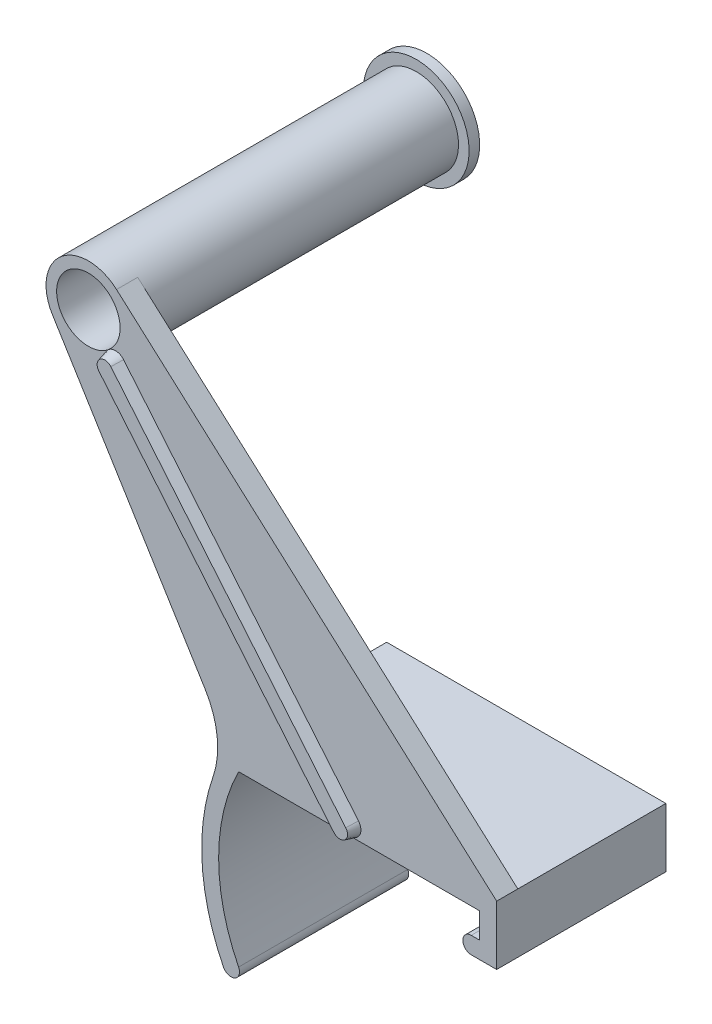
ISO-10303-21;
HEADER;
FILE_DESCRIPTION(('STEP AP214'),'2;1');
FILE_NAME('part.step','',(''),(''),'','','');
FILE_SCHEMA(('AUTOMOTIVE_DESIGN { 1 0 10303 214 1 1 1 1 }'));
ENDSEC;
DATA;
#1=APPLICATION_CONTEXT('core data for automotive mechanical design processes');
#2=APPLICATION_PROTOCOL_DEFINITION('international standard','automotive_design',2000,#1);
#3=PRODUCT_CONTEXT('',#1,'mechanical');
#4=PRODUCT('Part','Part','',(#3));
#5=PRODUCT_RELATED_PRODUCT_CATEGORY('part','',(#4));
#6=PRODUCT_DEFINITION_FORMATION('','',#4);
#7=PRODUCT_DEFINITION_CONTEXT('part definition',#1,'design');
#8=PRODUCT_DEFINITION('design','',#6,#7);
#9=PRODUCT_DEFINITION_SHAPE('','',#8);
#10=(LENGTH_UNIT() NAMED_UNIT(*) SI_UNIT(.MILLI.,.METRE.));
#11=(NAMED_UNIT(*) PLANE_ANGLE_UNIT() SI_UNIT($,.RADIAN.));
#12=(NAMED_UNIT(*) SI_UNIT($,.STERADIAN.) SOLID_ANGLE_UNIT());
#13=UNCERTAINTY_MEASURE_WITH_UNIT(LENGTH_MEASURE(1.E-05),#10,'distance_accuracy_value','');
#14=(GEOMETRIC_REPRESENTATION_CONTEXT(3) GLOBAL_UNCERTAINTY_ASSIGNED_CONTEXT((#13)) GLOBAL_UNIT_ASSIGNED_CONTEXT((#10,
#11,#12)) REPRESENTATION_CONTEXT('',''));
#15=CARTESIAN_POINT('',(0.,0.,0.));
#16=DIRECTION('',(0.,0.,1.));
#17=DIRECTION('',(1.,0.,0.));
#18=AXIS2_PLACEMENT_3D('',#15,#16,#17);
#19=CARTESIAN_POINT('',(0.,0.,0.));
#20=DIRECTION('',(0.,0.,1.));
#21=DIRECTION('',(1.,0.,0.));
#22=AXIS2_PLACEMENT_3D('',#19,#20,#21);
#23=PLANE('',#22);
#24=CARTESIAN_POINT('',(-117.495767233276,105.186312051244,0.));
#25=DIRECTION('',(0.,0.,1.));
#26=DIRECTION('',(1.,0.,0.));
#27=AXIS2_PLACEMENT_3D('',#24,#25,#26);
#28=CIRCLE('',#27,9.52499999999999);
#29=CARTESIAN_POINT('',(-111.39820969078,97.8688386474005,0.));
#30=VERTEX_POINT('',#29);
#31=EDGE_CURVE('E268',#30,#30,#28,.T.);
#32=ORIENTED_EDGE('',*,*,#31,.F.);
#33=CARTESIAN_POINT('',(-109.365690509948,95.4296808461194,0.));
#34=DIRECTION('',(0.,0.,1.));
#35=DIRECTION('',(1.,0.,0.));
#36=AXIS2_PLACEMENT_3D('',#33,#34,#35);
#37=CIRCLE('',#36,3.175);
#38=CARTESIAN_POINT('',(-106.926532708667,97.4622000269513,0.));
#39=VERTEX_POINT('',#38);
#40=EDGE_CURVE('E11',#30,#39,#37,.F.);
#41=ORIENTED_EDGE('',*,*,#40,.T.);
#42=DIRECTION('',(0.640163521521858,-0.768238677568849,0.));
#43=VECTOR('',#42,1.);
#44=CARTESIAN_POINT('',(-15.1752897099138,-12.6453759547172,0.));
#45=LINE('',#44,#43);
#46=CARTESIAN_POINT('',(-36.4015293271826,12.8275191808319,0.));
#47=VERTEX_POINT('',#46);
#48=EDGE_CURVE('E56',#39,#47,#45,.T.);
#49=ORIENTED_EDGE('',*,*,#48,.T.);
#50=CARTESIAN_POINT('',(-38.8406871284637,10.795,0.));
#51=DIRECTION('',(0.,0.,1.));
#52=DIRECTION('',(1.,0.,0.));
#53=AXIS2_PLACEMENT_3D('',#50,#51,#52);
#54=CIRCLE('',#53,3.175);
#55=CARTESIAN_POINT('',(-38.8406871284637,7.62,0.));
#56=VERTEX_POINT('',#55);
#57=EDGE_CURVE('E44',#56,#47,#54,.T.);
#58=ORIENTED_EDGE('',*,*,#57,.F.);
#59=DIRECTION('',(-1.,0.,0.));
#60=VECTOR('',#59,1.);
#61=CARTESIAN_POINT('',(0.,7.62,0.));
#62=LINE('',#61,#60);
#63=CARTESIAN_POINT('',(0.,7.62,0.));
#64=VERTEX_POINT('',#63);
#65=EDGE_CURVE('E295',#64,#56,#62,.T.);
#66=ORIENTED_EDGE('',*,*,#65,.F.);
#67=DIRECTION('',(0.,1.,0.));
#68=VECTOR('',#67,1.);
#69=CARTESIAN_POINT('',(0.,0.,0.));
#70=LINE('',#69,#68);
#71=CARTESIAN_POINT('',(0.,0.,0.));
#72=VERTEX_POINT('',#71);
#73=EDGE_CURVE('E297',#72,#64,#70,.T.);
#74=ORIENTED_EDGE('',*,*,#73,.F.);
#75=DIRECTION('',(1.,0.,0.));
#76=VECTOR('',#75,1.);
#77=CARTESIAN_POINT('',(0.,0.,0.));
#78=LINE('',#77,#76);
#79=CARTESIAN_POINT('',(-2.54,0.,0.));
#80=VERTEX_POINT('',#79);
#81=EDGE_CURVE('E299',#80,#72,#78,.T.);
#82=ORIENTED_EDGE('',*,*,#81,.F.);
#83=CARTESIAN_POINT('',(-2.54,-2.54,0.));
#84=DIRECTION('',(0.,0.,1.));
#85=DIRECTION('',(1.,0.,0.));
#86=AXIS2_PLACEMENT_3D('',#83,#84,#85);
#87=CIRCLE('',#86,2.54);
#88=CARTESIAN_POINT('',(-2.54,-5.08,0.));
#89=VERTEX_POINT('',#88);
#90=EDGE_CURVE('E301',#80,#89,#87,.T.);
#91=ORIENTED_EDGE('',*,*,#90,.T.);
#92=DIRECTION('',(1.,0.,0.));
#93=VECTOR('',#92,1.);
#94=CARTESIAN_POINT('',(0.,-5.08,0.));
#95=LINE('',#94,#93);
#96=CARTESIAN_POINT('',(5.08,-5.08,0.));
#97=VERTEX_POINT('',#96);
#98=EDGE_CURVE('E304',#89,#97,#95,.T.);
#99=ORIENTED_EDGE('',*,*,#98,.T.);
#100=DIRECTION('',(0.,1.,0.));
#101=VECTOR('',#100,1.);
#102=CARTESIAN_POINT('',(5.08,0.,0.));
#103=LINE('',#102,#101);
#104=CARTESIAN_POINT('',(5.08,12.7,0.));
#105=VERTEX_POINT('',#104);
#106=EDGE_CURVE('E263',#97,#105,#103,.T.);
#107=ORIENTED_EDGE('',*,*,#106,.T.);
#108=DIRECTION('',(0.745712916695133,-0.666267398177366,0.));
#109=VECTOR('',#108,1.);
#110=CARTESIAN_POINT('',(8.56499560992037,9.58628303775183,0.));
#111=LINE('',#110,#109);
#112=CARTESIAN_POINT('',(-109.034171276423,114.656866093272,0.));
#113=VERTEX_POINT('',#112);
#114=EDGE_CURVE('E276',#113,#105,#111,.T.);
#115=ORIENTED_EDGE('',*,*,#114,.F.);
#116=CARTESIAN_POINT('',(-117.495767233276,105.186312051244,0.));
#117=DIRECTION('',(0.,0.,1.));
#118=DIRECTION('',(1.,0.,0.));
#119=AXIS2_PLACEMENT_3D('',#116,#117,#118);
#120=CIRCLE('',#119,12.7);
#121=CARTESIAN_POINT('',(-128.30873191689,98.5252464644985,0.));
#122=VERTEX_POINT('',#121);
#123=EDGE_CURVE('E279',#113,#122,#120,.T.);
#124=ORIENTED_EDGE('',*,*,#123,.T.);
#125=DIRECTION('',(0.524493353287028,-0.85141454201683,0.));
#126=VECTOR('',#125,1.);
#127=CARTESIAN_POINT('',(-49.0143032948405,-30.1940770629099,0.));
#128=LINE('',#127,#126);
#129=CARTESIAN_POINT('',(-82.4447526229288,24.0738569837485,0.));
#130=VERTEX_POINT('',#129);
#131=EDGE_CURVE('E282',#122,#130,#128,.T.);
#132=ORIENTED_EDGE('',*,*,#131,.T.);
#133=CARTESIAN_POINT('',(-104.070681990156,10.751725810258,0.));
#134=DIRECTION('',(0.,0.,1.));
#135=DIRECTION('',(1.,0.,0.));
#136=AXIS2_PLACEMENT_3D('',#133,#134,#135);
#137=CIRCLE('',#136,25.4);
#138=CARTESIAN_POINT('',(-80.0663018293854,2.44812821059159,0.));
#139=VERTEX_POINT('',#138);
#140=EDGE_CURVE('E285',#130,#139,#137,.F.);
#141=ORIENTED_EDGE('',*,*,#140,.T.);
#142=CARTESIAN_POINT('',(-21.59,-17.78,0.));
#143=DIRECTION('',(0.,0.,1.));
#144=DIRECTION('',(1.,0.,0.));
#145=AXIS2_PLACEMENT_3D('',#142,#143,#144);
#146=CIRCLE('',#145,61.8761266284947);
#147=CARTESIAN_POINT('',(-76.9336901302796,-45.4518450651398,0.));
#148=VERTEX_POINT('',#147);
#149=EDGE_CURVE('E287',#139,#148,#146,.T.);
#150=ORIENTED_EDGE('',*,*,#149,.T.);
#151=CARTESIAN_POINT('',(-74.6618450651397,-44.3159225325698,0.));
#152=DIRECTION('',(0.,0.,1.));
#153=DIRECTION('',(1.,0.,0.));
#154=AXIS2_PLACEMENT_3D('',#151,#152,#153);
#155=CIRCLE('',#154,2.54000000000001);
#156=CARTESIAN_POINT('',(-72.39,-43.18,0.));
#157=VERTEX_POINT('',#156);
#158=EDGE_CURVE('E290',#157,#148,#155,.F.);
#159=ORIENTED_EDGE('',*,*,#158,.F.);
#160=CARTESIAN_POINT('',(-21.59,-17.78,0.));
#161=DIRECTION('',(0.,0.,1.));
#162=DIRECTION('',(1.,0.,0.));
#163=AXIS2_PLACEMENT_3D('',#160,#161,#162);
#164=CIRCLE('',#163,56.7961266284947);
#165=CARTESIAN_POINT('',(-72.39,7.62,0.));
#166=VERTEX_POINT('',#165);
#167=EDGE_CURVE('E293',#166,#157,#164,.T.);
#168=ORIENTED_EDGE('',*,*,#167,.F.);
#169=EDGE_CURVE('E174',#56,#166,#62,.T.);
#170=ORIENTED_EDGE('',*,*,#169,.F.);
#171=CARTESIAN_POINT('',(-41.2798449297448,8.76248081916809,0.));
#172=VERTEX_POINT('',#171);
#173=EDGE_CURVE('E169',#172,#56,#54,.T.);
#174=ORIENTED_EDGE('',*,*,#173,.F.);
#175=DIRECTION('',(0.640163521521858,-0.768238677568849,0.));
#176=VECTOR('',#175,1.);
#177=CARTESIAN_POINT('',(-20.053605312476,-16.710414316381,0.));
#178=LINE('',#177,#176);
#179=CARTESIAN_POINT('',(-111.804848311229,93.3971616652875,0.));
#180=VERTEX_POINT('',#179);
#181=EDGE_CURVE('E171',#180,#172,#178,.T.);
#182=ORIENTED_EDGE('',*,*,#181,.F.);
#183=EDGE_CURVE('E46',#180,#30,#37,.F.);
#184=ORIENTED_EDGE('',*,*,#183,.T.);
#185=EDGE_LOOP('',(#32,#41,#49,#58,#66,#74,#82,#91,#99,#107,#115,#124,#132,#141,#150,#159,#168,
#170,#174,#182,#184));
#186=FACE_BOUND('',#185,.T.);
#187=ADVANCED_FACE('F35',(#186),#23,.T.);
#188=CARTESIAN_POINT('',(-117.495767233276,105.186312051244,-6.35));
#189=DIRECTION('',(0.,0.,1.));
#190=DIRECTION('',(1.,0.,0.));
#191=AXIS2_PLACEMENT_3D('',#188,#189,#190);
#192=CYLINDRICAL_SURFACE('',#191,12.7);
#193=ORIENTED_EDGE('',*,*,#123,.F.);
#194=DIRECTION('',(0.,0.,1.));
#195=VECTOR('',#194,1.);
#196=CARTESIAN_POINT('',(-109.034171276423,114.656866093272,-6.35));
#197=LINE('',#196,#195);
#198=CARTESIAN_POINT('',(-109.034171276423,114.656866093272,-6.35));
#199=VERTEX_POINT('',#198);
#200=EDGE_CURVE('E335',#199,#113,#197,.T.);
#201=ORIENTED_EDGE('',*,*,#200,.F.);
#202=CARTESIAN_POINT('',(-117.495767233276,105.186312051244,-6.34999999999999));
#203=DIRECTION('',(0.,0.,1.));
#204=DIRECTION('',(1.,0.,0.));
#205=AXIS2_PLACEMENT_3D('',#202,#203,#204);
#206=CIRCLE('',#205,12.7);
#207=CARTESIAN_POINT('',(-128.30873191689,98.5252464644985,-6.34999999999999));
#208=VERTEX_POINT('',#207);
#209=EDGE_CURVE('E220',#208,#199,#206,.T.);
#210=ORIENTED_EDGE('',*,*,#209,.F.);
#211=DIRECTION('',(0.,0.,1.));
#212=VECTOR('',#211,1.);
#213=CARTESIAN_POINT('',(-128.30873191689,98.5252464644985,-6.35));
#214=LINE('',#213,#212);
#215=EDGE_CURVE('E334',#208,#122,#214,.T.);
#216=ORIENTED_EDGE('',*,*,#215,.T.);
#217=EDGE_LOOP('',(#193,#201,#210,#216));
#218=FACE_BOUND('',#217,.T.);
#219=CARTESIAN_POINT('',(-117.495767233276,105.186312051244,-98.425));
#220=DIRECTION('',(0.,0.,-1.));
#221=DIRECTION('',(-1.,0.,0.));
#222=AXIS2_PLACEMENT_3D('',#219,#220,#221);
#223=CIRCLE('',#222,12.7);
#224=CARTESIAN_POINT('',(-130.195767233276,105.186312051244,-98.425));
#225=VERTEX_POINT('',#224);
#226=EDGE_CURVE('E212',#225,#225,#223,.F.);
#227=ORIENTED_EDGE('',*,*,#226,.T.);
#228=EDGE_LOOP('',(#227));
#229=FACE_BOUND('',#228,.T.);
#230=ADVANCED_FACE('F372',(#218,#229),#192,.T.);
#231=CARTESIAN_POINT('',(5.08,0.,-6.35));
#232=DIRECTION('',(1.,0.,0.));
#233=DIRECTION('',(0.,0.,-1.));
#234=AXIS2_PLACEMENT_3D('',#231,#232,#233);
#235=PLANE('',#234);
#236=ORIENTED_EDGE('',*,*,#106,.F.);
#237=DIRECTION('',(0.,0.,1.));
#238=VECTOR('',#237,1.);
#239=CARTESIAN_POINT('',(5.08,-5.08,-6.35));
#240=LINE('',#239,#238);
#241=CARTESIAN_POINT('',(5.08,-5.08,-50.8));
#242=VERTEX_POINT('',#241);
#243=EDGE_CURVE('E309',#242,#97,#240,.T.);
#244=ORIENTED_EDGE('',*,*,#243,.F.);
#245=DIRECTION('',(0.,1.,0.));
#246=VECTOR('',#245,1.);
#247=CARTESIAN_POINT('',(5.08,0.,-50.8));
#248=LINE('',#247,#246);
#249=CARTESIAN_POINT('',(5.08,12.7,-50.8));
#250=VERTEX_POINT('',#249);
#251=EDGE_CURVE('E252',#242,#250,#248,.T.);
#252=ORIENTED_EDGE('',*,*,#251,.T.);
#253=DIRECTION('',(0.,0.,1.));
#254=VECTOR('',#253,1.);
#255=CARTESIAN_POINT('',(5.08,12.7,-50.8));
#256=LINE('',#255,#254);
#257=CARTESIAN_POINT('',(5.08,12.7,-6.35));
#258=VERTEX_POINT('',#257);
#259=EDGE_CURVE('E256',#250,#258,#256,.T.);
#260=ORIENTED_EDGE('',*,*,#259,.T.);
#261=DIRECTION('',(0.,0.,1.));
#262=VECTOR('',#261,1.);
#263=CARTESIAN_POINT('',(5.08,12.7,-6.35));
#264=LINE('',#263,#262);
#265=EDGE_CURVE('E39',#258,#105,#264,.T.);
#266=ORIENTED_EDGE('',*,*,#265,.T.);
#267=EDGE_LOOP('',(#236,#244,#252,#260,#266));
#268=FACE_BOUND('',#267,.T.);
#269=ADVANCED_FACE('F37',(#268),#235,.T.);
#270=CARTESIAN_POINT('',(0.,-5.08,-6.35));
#271=DIRECTION('',(0.,-1.,0.));
#272=DIRECTION('',(0.,0.,-1.));
#273=AXIS2_PLACEMENT_3D('',#270,#271,#272);
#274=PLANE('',#273);
#275=ORIENTED_EDGE('',*,*,#98,.F.);
#276=DIRECTION('',(0.,0.,1.));
#277=VECTOR('',#276,1.);
#278=CARTESIAN_POINT('',(-2.54,-5.08,-6.35));
#279=LINE('',#278,#277);
#280=CARTESIAN_POINT('',(-2.54,-5.08,-50.8));
#281=VERTEX_POINT('',#280);
#282=EDGE_CURVE('E311',#281,#89,#279,.T.);
#283=ORIENTED_EDGE('',*,*,#282,.F.);
#284=DIRECTION('',(1.,0.,0.));
#285=VECTOR('',#284,1.);
#286=CARTESIAN_POINT('',(0.,-5.08,-50.8));
#287=LINE('',#286,#285);
#288=EDGE_CURVE('E249',#281,#242,#287,.T.);
#289=ORIENTED_EDGE('',*,*,#288,.T.);
#290=ORIENTED_EDGE('',*,*,#243,.T.);
#291=EDGE_LOOP('',(#275,#283,#289,#290));
#292=FACE_BOUND('',#291,.T.);
#293=ADVANCED_FACE('F349',(#292),#274,.T.);
#294=CARTESIAN_POINT('',(-2.54,-2.54,-6.35));
#295=DIRECTION('',(0.,0.,1.));
#296=DIRECTION('',(1.,0.,0.));
#297=AXIS2_PLACEMENT_3D('',#294,#295,#296);
#298=CYLINDRICAL_SURFACE('',#297,2.54);
#299=ORIENTED_EDGE('',*,*,#90,.F.);
#300=DIRECTION('',(0.,0.,1.));
#301=VECTOR('',#300,1.);
#302=CARTESIAN_POINT('',(-2.54,0.,-6.35));
#303=LINE('',#302,#301);
#304=CARTESIAN_POINT('',(-2.54,0.,-50.8));
#305=VERTEX_POINT('',#304);
#306=EDGE_CURVE('E313',#305,#80,#303,.T.);
#307=ORIENTED_EDGE('',*,*,#306,.F.);
#308=CARTESIAN_POINT('',(-2.54,-2.54,-50.8));
#309=DIRECTION('',(0.,0.,1.));
#310=DIRECTION('',(1.,0.,0.));
#311=AXIS2_PLACEMENT_3D('',#308,#309,#310);
#312=CIRCLE('',#311,2.54);
#313=EDGE_CURVE('E246',#305,#281,#312,.T.);
#314=ORIENTED_EDGE('',*,*,#313,.T.);
#315=ORIENTED_EDGE('',*,*,#282,.T.);
#316=EDGE_LOOP('',(#299,#307,#314,#315));
#317=FACE_BOUND('',#316,.T.);
#318=ADVANCED_FACE('F424',(#317),#298,.T.);
#319=CARTESIAN_POINT('',(0.,0.,-6.35));
#320=DIRECTION('',(0.,-1.,0.));
#321=DIRECTION('',(0.,0.,-1.));
#322=AXIS2_PLACEMENT_3D('',#319,#320,#321);
#323=PLANE('',#322);
#324=ORIENTED_EDGE('',*,*,#81,.T.);
#325=DIRECTION('',(0.,0.,1.));
#326=VECTOR('',#325,1.);
#327=CARTESIAN_POINT('',(0.,0.,-6.35));
#328=LINE('',#327,#326);
#329=CARTESIAN_POINT('',(0.,0.,-50.8));
#330=VERTEX_POINT('',#329);
#331=EDGE_CURVE('E315',#330,#72,#328,.T.);
#332=ORIENTED_EDGE('',*,*,#331,.F.);
#333=DIRECTION('',(1.,0.,0.));
#334=VECTOR('',#333,1.);
#335=CARTESIAN_POINT('',(0.,0.,-50.8));
#336=LINE('',#335,#334);
#337=EDGE_CURVE('E243',#305,#330,#336,.T.);
#338=ORIENTED_EDGE('',*,*,#337,.F.);
#339=ORIENTED_EDGE('',*,*,#306,.T.);
#340=EDGE_LOOP('',(#324,#332,#338,#339));
#341=FACE_BOUND('',#340,.T.);
#342=ADVANCED_FACE('F427',(#341),#323,.F.);
#343=CARTESIAN_POINT('',(0.,0.,-6.35));
#344=DIRECTION('',(1.,0.,0.));
#345=DIRECTION('',(0.,0.,-1.));
#346=AXIS2_PLACEMENT_3D('',#343,#344,#345);
#347=PLANE('',#346);
#348=ORIENTED_EDGE('',*,*,#73,.T.);
#349=DIRECTION('',(0.,0.,1.));
#350=VECTOR('',#349,1.);
#351=CARTESIAN_POINT('',(0.,7.62,-6.35));
#352=LINE('',#351,#350);
#353=CARTESIAN_POINT('',(0.,7.62,-50.8));
#354=VERTEX_POINT('',#353);
#355=EDGE_CURVE('E318',#354,#64,#352,.T.);
#356=ORIENTED_EDGE('',*,*,#355,.F.);
#357=DIRECTION('',(0.,1.,0.));
#358=VECTOR('',#357,1.);
#359=CARTESIAN_POINT('',(0.,0.,-50.8));
#360=LINE('',#359,#358);
#361=EDGE_CURVE('E240',#330,#354,#360,.T.);
#362=ORIENTED_EDGE('',*,*,#361,.F.);
#363=ORIENTED_EDGE('',*,*,#331,.T.);
#364=EDGE_LOOP('',(#348,#356,#362,#363));
#365=FACE_BOUND('',#364,.T.);
#366=ADVANCED_FACE('F390',(#365),#347,.F.);
#367=CARTESIAN_POINT('',(0.,7.62,-6.35));
#368=DIRECTION('',(0.,1.,0.));
#369=DIRECTION('',(-1.,0.,0.));
#370=AXIS2_PLACEMENT_3D('',#367,#368,#369);
#371=PLANE('',#370);
#372=ORIENTED_EDGE('',*,*,#65,.T.);
#373=ORIENTED_EDGE('',*,*,#169,.T.);
#374=DIRECTION('',(0.,0.,1.));
#375=VECTOR('',#374,1.);
#376=CARTESIAN_POINT('',(-72.39,7.62,-6.35));
#377=LINE('',#376,#375);
#378=CARTESIAN_POINT('',(-72.39,7.62,-50.8));
#379=VERTEX_POINT('',#378);
#380=EDGE_CURVE('E321',#379,#166,#377,.T.);
#381=ORIENTED_EDGE('',*,*,#380,.F.);
#382=DIRECTION('',(-1.,0.,0.));
#383=VECTOR('',#382,1.);
#384=CARTESIAN_POINT('',(0.,7.62,-50.8));
#385=LINE('',#384,#383);
#386=EDGE_CURVE('E237',#354,#379,#385,.T.);
#387=ORIENTED_EDGE('',*,*,#386,.F.);
#388=ORIENTED_EDGE('',*,*,#355,.T.);
#389=EDGE_LOOP('',(#372,#373,#381,#387,#388));
#390=FACE_BOUND('',#389,.T.);
#391=ADVANCED_FACE('F386',(#390),#371,.F.);
#392=CARTESIAN_POINT('',(-21.59,-17.78,-6.35));
#393=DIRECTION('',(0.,0.,1.));
#394=DIRECTION('',(1.,0.,0.));
#395=AXIS2_PLACEMENT_3D('',#392,#393,#394);
#396=CYLINDRICAL_SURFACE('',#395,56.7961266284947);
#397=ORIENTED_EDGE('',*,*,#167,.T.);
#398=DIRECTION('',(0.,0.,1.));
#399=VECTOR('',#398,1.);
#400=CARTESIAN_POINT('',(-72.39,-43.18,-6.35));
#401=LINE('',#400,#399);
#402=CARTESIAN_POINT('',(-72.39,-43.18,-50.8));
#403=VERTEX_POINT('',#402);
#404=EDGE_CURVE('E324',#403,#157,#401,.T.);
#405=ORIENTED_EDGE('',*,*,#404,.F.);
#406=CARTESIAN_POINT('',(-21.59,-17.78,-50.8));
#407=DIRECTION('',(0.,0.,1.));
#408=DIRECTION('',(1.,0.,0.));
#409=AXIS2_PLACEMENT_3D('',#406,#407,#408);
#410=CIRCLE('',#409,56.7961266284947);
#411=EDGE_CURVE('E234',#379,#403,#410,.T.);
#412=ORIENTED_EDGE('',*,*,#411,.F.);
#413=ORIENTED_EDGE('',*,*,#380,.T.);
#414=EDGE_LOOP('',(#397,#405,#412,#413));
#415=FACE_BOUND('',#414,.T.);
#416=ADVANCED_FACE('F382',(#415),#396,.F.);
#417=CARTESIAN_POINT('',(-74.6618450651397,-44.3159225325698,-6.35));
#418=DIRECTION('',(0.,0.,1.));
#419=DIRECTION('',(1.,0.,0.));
#420=AXIS2_PLACEMENT_3D('',#417,#418,#419);
#421=CYLINDRICAL_SURFACE('',#420,2.54000000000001);
#422=ORIENTED_EDGE('',*,*,#158,.T.);
#423=DIRECTION('',(0.,0.,1.));
#424=VECTOR('',#423,1.);
#425=CARTESIAN_POINT('',(-76.9336901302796,-45.4518450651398,-6.35));
#426=LINE('',#425,#424);
#427=CARTESIAN_POINT('',(-76.9336901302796,-45.4518450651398,-50.8));
#428=VERTEX_POINT('',#427);
#429=EDGE_CURVE('E327',#428,#148,#426,.T.);
#430=ORIENTED_EDGE('',*,*,#429,.F.);
#431=CARTESIAN_POINT('',(-74.6618450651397,-44.3159225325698,-50.8));
#432=DIRECTION('',(0.,0.,1.));
#433=DIRECTION('',(1.,0.,0.));
#434=AXIS2_PLACEMENT_3D('',#431,#432,#433);
#435=CIRCLE('',#434,2.54000000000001);
#436=EDGE_CURVE('E231',#403,#428,#435,.F.);
#437=ORIENTED_EDGE('',*,*,#436,.F.);
#438=ORIENTED_EDGE('',*,*,#404,.T.);
#439=EDGE_LOOP('',(#422,#430,#437,#438));
#440=FACE_BOUND('',#439,.T.);
#441=ADVANCED_FACE('F380',(#440),#421,.T.);
#442=CARTESIAN_POINT('',(-21.59,-17.78,-6.35));
#443=DIRECTION('',(0.,0.,1.));
#444=DIRECTION('',(1.,0.,0.));
#445=AXIS2_PLACEMENT_3D('',#442,#443,#444);
#446=CYLINDRICAL_SURFACE('',#445,61.8761266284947);
#447=ORIENTED_EDGE('',*,*,#149,.F.);
#448=DIRECTION('',(0.,0.,1.));
#449=VECTOR('',#448,1.);
#450=CARTESIAN_POINT('',(-80.0663018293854,2.44812821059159,-6.35));
#451=LINE('',#450,#449);
#452=CARTESIAN_POINT('',(-80.0663018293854,2.44812821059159,-50.8));
#453=VERTEX_POINT('',#452);
#454=EDGE_CURVE('E329',#453,#139,#451,.T.);
#455=ORIENTED_EDGE('',*,*,#454,.F.);
#456=CARTESIAN_POINT('',(-21.59,-17.78,-50.8));
#457=DIRECTION('',(0.,0.,1.));
#458=DIRECTION('',(1.,0.,0.));
#459=AXIS2_PLACEMENT_3D('',#456,#457,#458);
#460=CIRCLE('',#459,61.8761266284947);
#461=EDGE_CURVE('E228',#453,#428,#460,.T.);
#462=ORIENTED_EDGE('',*,*,#461,.T.);
#463=ORIENTED_EDGE('',*,*,#429,.T.);
#464=EDGE_LOOP('',(#447,#455,#462,#463));
#465=FACE_BOUND('',#464,.T.);
#466=ADVANCED_FACE('F377',(#465),#446,.T.);
#467=CARTESIAN_POINT('',(-104.070681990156,10.751725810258,-6.35));
#468=DIRECTION('',(0.,0.,1.));
#469=DIRECTION('',(1.,0.,0.));
#470=AXIS2_PLACEMENT_3D('',#467,#468,#469);
#471=CYLINDRICAL_SURFACE('',#470,25.4);
#472=CARTESIAN_POINT('',(-104.070681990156,10.751725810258,-6.35));
#473=DIRECTION('',(0.,0.,1.));
#474=DIRECTION('',(1.,0.,0.));
#475=AXIS2_PLACEMENT_3D('',#472,#473,#474);
#476=CIRCLE('',#475,25.4);
#477=CARTESIAN_POINT('',(-82.4447526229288,24.0738569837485,-6.35));
#478=VERTEX_POINT('',#477);
#479=CARTESIAN_POINT('',(-78.7455121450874,12.7,-6.35));
#480=VERTEX_POINT('',#479);
#481=EDGE_CURVE('E271',#478,#480,#476,.F.);
#482=ORIENTED_EDGE('',*,*,#481,.T.);
#483=DIRECTION('',(0.,0.,1.));
#484=VECTOR('',#483,1.);
#485=CARTESIAN_POINT('',(-78.7455121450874,12.7,-50.8));
#486=LINE('',#485,#484);
#487=CARTESIAN_POINT('',(-78.7455121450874,12.7,-50.8));
#488=VERTEX_POINT('',#487);
#489=EDGE_CURVE('E255',#488,#480,#486,.T.);
#490=ORIENTED_EDGE('',*,*,#489,.F.);
#491=CARTESIAN_POINT('',(-104.070681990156,10.751725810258,-50.8));
#492=DIRECTION('',(0.,0.,1.));
#493=DIRECTION('',(1.,0.,0.));
#494=AXIS2_PLACEMENT_3D('',#491,#492,#493);
#495=CIRCLE('',#494,25.4);
#496=EDGE_CURVE('E225',#488,#453,#495,.F.);
#497=ORIENTED_EDGE('',*,*,#496,.T.);
#498=ORIENTED_EDGE('',*,*,#454,.T.);
#499=ORIENTED_EDGE('',*,*,#140,.F.);
#500=DIRECTION('',(0.,0.,1.));
#501=VECTOR('',#500,1.);
#502=CARTESIAN_POINT('',(-82.4447526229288,24.0738569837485,-6.35));
#503=LINE('',#502,#501);
#504=EDGE_CURVE('E332',#478,#130,#503,.T.);
#505=ORIENTED_EDGE('',*,*,#504,.F.);
#506=EDGE_LOOP('',(#482,#490,#497,#498,#499,#505));
#507=FACE_BOUND('',#506,.T.);
#508=ADVANCED_FACE('F365',(#507),#471,.F.);
#509=CARTESIAN_POINT('',(-49.0143032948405,-30.1940770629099,-6.35));
#510=DIRECTION('',(-0.85141454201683,-0.524493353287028,0.));
#511=DIRECTION('',(0.524493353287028,-0.85141454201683,0.));
#512=AXIS2_PLACEMENT_3D('',#509,#510,#511);
#513=PLANE('',#512);
#514=ORIENTED_EDGE('',*,*,#131,.F.);
#515=ORIENTED_EDGE('',*,*,#215,.F.);
#516=DIRECTION('',(0.524493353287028,-0.85141454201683,0.));
#517=VECTOR('',#516,1.);
#518=CARTESIAN_POINT('',(-49.0143032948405,-30.1940770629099,-6.35));
#519=LINE('',#518,#517);
#520=EDGE_CURVE('E267',#208,#478,#519,.T.);
#521=ORIENTED_EDGE('',*,*,#520,.T.);
#522=ORIENTED_EDGE('',*,*,#504,.T.);
#523=EDGE_LOOP('',(#514,#515,#521,#522));
#524=FACE_BOUND('',#523,.T.);
#525=ADVANCED_FACE('F369',(#524),#513,.T.);
#526=CARTESIAN_POINT('',(8.56499560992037,9.58628303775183,-6.35));
#527=DIRECTION('',(-0.666267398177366,-0.745712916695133,0.));
#528=DIRECTION('',(0.745712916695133,-0.666267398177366,0.));
#529=AXIS2_PLACEMENT_3D('',#526,#527,#528);
#530=PLANE('',#529);
#531=ORIENTED_EDGE('',*,*,#114,.T.);
#532=ORIENTED_EDGE('',*,*,#265,.F.);
#533=DIRECTION('',(0.745712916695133,-0.666267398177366,0.));
#534=VECTOR('',#533,1.);
#535=CARTESIAN_POINT('',(8.56499560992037,9.58628303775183,-6.35));
#536=LINE('',#535,#534);
#537=EDGE_CURVE('E264',#199,#258,#536,.T.);
#538=ORIENTED_EDGE('',*,*,#537,.F.);
#539=ORIENTED_EDGE('',*,*,#200,.T.);
#540=EDGE_LOOP('',(#531,#532,#538,#539));
#541=FACE_BOUND('',#540,.T.);
#542=ADVANCED_FACE('F343',(#541),#530,.F.);
#543=CARTESIAN_POINT('',(-117.495767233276,105.186312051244,-6.35));
#544=DIRECTION('',(0.,0.,1.));
#545=DIRECTION('',(1.,0.,0.));
#546=AXIS2_PLACEMENT_3D('',#543,#544,#545);
#547=CYLINDRICAL_SURFACE('',#546,9.52499999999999);
#548=CARTESIAN_POINT('',(-117.495767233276,105.186312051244,-101.6));
#549=DIRECTION('',(0.,0.,1.));
#550=DIRECTION('',(1.,0.,0.));
#551=AXIS2_PLACEMENT_3D('',#548,#549,#550);
#552=CIRCLE('',#551,9.52499999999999);
#553=CARTESIAN_POINT('',(-107.970767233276,105.186312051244,-101.6));
#554=VERTEX_POINT('',#553);
#555=EDGE_CURVE('E217',#554,#554,#552,.T.);
#556=ORIENTED_EDGE('',*,*,#555,.F.);
#557=EDGE_LOOP('',(#556));
#558=FACE_BOUND('',#557,.T.);
#559=ORIENTED_EDGE('',*,*,#31,.T.);
#560=EDGE_LOOP('',(#559));
#561=FACE_BOUND('',#560,.T.);
#562=ADVANCED_FACE('F418',(#558,#561),#547,.F.);
#563=CARTESIAN_POINT('',(0.,0.,-6.35));
#564=DIRECTION('',(0.,0.,1.));
#565=DIRECTION('',(1.,0.,0.));
#566=AXIS2_PLACEMENT_3D('',#563,#564,#565);
#567=PLANE('',#566);
#568=ORIENTED_EDGE('',*,*,#520,.F.);
#569=ORIENTED_EDGE('',*,*,#209,.T.);
#570=ORIENTED_EDGE('',*,*,#537,.T.);
#571=DIRECTION('',(-1.,0.,0.));
#572=VECTOR('',#571,1.);
#573=CARTESIAN_POINT('',(0.,12.7,-6.35));
#574=LINE('',#573,#572);
#575=EDGE_CURVE('E259',#258,#480,#574,.T.);
#576=ORIENTED_EDGE('',*,*,#575,.T.);
#577=ORIENTED_EDGE('',*,*,#481,.F.);
#578=EDGE_LOOP('',(#568,#569,#570,#576,#577));
#579=FACE_BOUND('',#578,.T.);
#580=ADVANCED_FACE('F363',(#579),#567,.F.);
#581=CARTESIAN_POINT('',(0.,12.7,-50.8));
#582=DIRECTION('',(0.,1.,0.));
#583=DIRECTION('',(-1.,0.,0.));
#584=AXIS2_PLACEMENT_3D('',#581,#582,#583);
#585=PLANE('',#584);
#586=ORIENTED_EDGE('',*,*,#575,.F.);
#587=ORIENTED_EDGE('',*,*,#259,.F.);
#588=DIRECTION('',(-1.,0.,0.));
#589=VECTOR('',#588,1.);
#590=CARTESIAN_POINT('',(0.,12.7,-50.8));
#591=LINE('',#590,#589);
#592=EDGE_CURVE('E222',#250,#488,#591,.T.);
#593=ORIENTED_EDGE('',*,*,#592,.T.);
#594=ORIENTED_EDGE('',*,*,#489,.T.);
#595=EDGE_LOOP('',(#586,#587,#593,#594));
#596=FACE_BOUND('',#595,.T.);
#597=ADVANCED_FACE('F359',(#596),#585,.T.);
#598=CARTESIAN_POINT('',(0.,0.,-50.8));
#599=DIRECTION('',(0.,0.,1.));
#600=DIRECTION('',(1.,0.,0.));
#601=AXIS2_PLACEMENT_3D('',#598,#599,#600);
#602=PLANE('',#601);
#603=ORIENTED_EDGE('',*,*,#592,.F.);
#604=ORIENTED_EDGE('',*,*,#251,.F.);
#605=ORIENTED_EDGE('',*,*,#288,.F.);
#606=ORIENTED_EDGE('',*,*,#313,.F.);
#607=ORIENTED_EDGE('',*,*,#337,.T.);
#608=ORIENTED_EDGE('',*,*,#361,.T.);
#609=ORIENTED_EDGE('',*,*,#386,.T.);
#610=ORIENTED_EDGE('',*,*,#411,.T.);
#611=ORIENTED_EDGE('',*,*,#436,.T.);
#612=ORIENTED_EDGE('',*,*,#461,.F.);
#613=ORIENTED_EDGE('',*,*,#496,.F.);
#614=EDGE_LOOP('',(#603,#604,#605,#606,#607,#608,#609,#610,#611,#612,#613));
#615=FACE_BOUND('',#614,.T.);
#616=ADVANCED_FACE('F354',(#615),#602,.F.);
#617=CARTESIAN_POINT('',(0.,0.,-101.6));
#618=DIRECTION('',(0.,0.,1.));
#619=DIRECTION('',(1.,0.,0.));
#620=AXIS2_PLACEMENT_3D('',#617,#618,#619);
#621=PLANE('',#620);
#622=ORIENTED_EDGE('',*,*,#555,.T.);
#623=EDGE_LOOP('',(#622));
#624=FACE_BOUND('',#623,.T.);
#625=CARTESIAN_POINT('',(-117.495767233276,105.186312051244,-101.6));
#626=DIRECTION('',(0.,0.,-1.));
#627=DIRECTION('',(-1.,0.,0.));
#628=AXIS2_PLACEMENT_3D('',#625,#626,#627);
#629=CIRCLE('',#628,15.875);
#630=CARTESIAN_POINT('',(-133.370767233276,105.186312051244,-101.6));
#631=VERTEX_POINT('',#630);
#632=EDGE_CURVE('E193',#631,#631,#629,.T.);
#633=ORIENTED_EDGE('',*,*,#632,.T.);
#634=EDGE_LOOP('',(#633));
#635=FACE_BOUND('',#634,.T.);
#636=ADVANCED_FACE('F474',(#624,#635),#621,.F.);
#637=CARTESIAN_POINT('',(-117.495767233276,105.186312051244,-98.425));
#638=DIRECTION('',(0.,0.,-1.));
#639=DIRECTION('',(-1.,0.,0.));
#640=AXIS2_PLACEMENT_3D('',#637,#638,#639);
#641=CYLINDRICAL_SURFACE('',#640,15.875);
#642=CARTESIAN_POINT('',(-117.495767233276,105.186312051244,-98.425));
#643=DIRECTION('',(0.,0.,-1.));
#644=DIRECTION('',(-1.,0.,0.));
#645=AXIS2_PLACEMENT_3D('',#642,#643,#644);
#646=CIRCLE('',#645,15.875);
#647=CARTESIAN_POINT('',(-133.370767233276,105.186312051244,-98.425));
#648=VERTEX_POINT('',#647);
#649=EDGE_CURVE('E209',#648,#648,#646,.T.);
#650=ORIENTED_EDGE('',*,*,#649,.T.);
#651=EDGE_LOOP('',(#650));
#652=FACE_BOUND('',#651,.T.);
#653=ORIENTED_EDGE('',*,*,#632,.F.);
#654=EDGE_LOOP('',(#653));
#655=FACE_BOUND('',#654,.T.);
#656=ADVANCED_FACE('F481',(#652,#655),#641,.T.);
#657=CARTESIAN_POINT('',(-117.495767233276,105.186312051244,-98.425));
#658=DIRECTION('',(0.,0.,-1.));
#659=DIRECTION('',(-1.,0.,0.));
#660=AXIS2_PLACEMENT_3D('',#657,#658,#659);
#661=PLANE('',#660);
#662=ORIENTED_EDGE('',*,*,#226,.F.);
#663=EDGE_LOOP('',(#662));
#664=FACE_BOUND('',#663,.T.);
#665=ORIENTED_EDGE('',*,*,#649,.F.);
#666=EDGE_LOOP('',(#665));
#667=FACE_BOUND('',#666,.T.);
#668=ADVANCED_FACE('F489',(#664,#667),#661,.F.);
#669=CARTESIAN_POINT('',(-109.365690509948,95.4296808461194,0.));
#670=DIRECTION('',(0.,0.,-1.));
#671=DIRECTION('',(1.,0.,0.));
#672=AXIS2_PLACEMENT_3D('',#669,#670,#671);
#673=CONICAL_SURFACE('',#672,3.175,0.26179938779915);
#674=ORIENTED_EDGE('',*,*,#183,.F.);
#675=DIRECTION('',(-0.198834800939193,-0.165686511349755,-0.965925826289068));
#676=VECTOR('',#675,1.);
#677=CARTESIAN_POINT('',(-111.804848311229,93.3971616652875,0.));
#678=LINE('',#677,#676);
#679=CARTESIAN_POINT('',(-111.151277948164,93.9417735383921,3.175));
#680=VERTEX_POINT('',#679);
#681=EDGE_CURVE('E185',#680,#180,#678,.T.);
#682=ORIENTED_EDGE('',*,*,#681,.F.);
#683=CARTESIAN_POINT('',(-109.365690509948,95.4296808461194,3.175));
#684=DIRECTION('',(0.,0.,1.));
#685=DIRECTION('',(1.,0.,0.));
#686=AXIS2_PLACEMENT_3D('',#683,#684,#685);
#687=CIRCLE('',#686,2.32426131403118);
#688=CARTESIAN_POINT('',(-107.580103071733,96.9175881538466,3.175));
#689=VERTEX_POINT('',#688);
#690=EDGE_CURVE('E200',#680,#689,#687,.F.);
#691=ORIENTED_EDGE('',*,*,#690,.T.);
#692=DIRECTION('',(0.198834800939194,0.165686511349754,-0.965925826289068));
#693=VECTOR('',#692,1.);
#694=CARTESIAN_POINT('',(-106.926532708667,97.4622000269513,0.));
#695=LINE('',#694,#693);
#696=EDGE_CURVE('E196',#689,#39,#695,.T.);
#697=ORIENTED_EDGE('',*,*,#696,.T.);
#698=ORIENTED_EDGE('',*,*,#40,.F.);
#699=EDGE_LOOP('',(#674,#682,#691,#697,#698));
#700=FACE_BOUND('',#699,.T.);
#701=ADVANCED_FACE('F395',(#700),#673,.T.);
#702=CARTESIAN_POINT('',(-20.053605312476,-16.710414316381,0.));
#703=DIRECTION('',(-0.742061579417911,-0.61835047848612,0.258819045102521));
#704=DIRECTION('',(0.640163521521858,-0.768238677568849,0.));
#705=AXIS2_PLACEMENT_3D('',#702,#703,#704);
#706=PLANE('',#705);
#707=ORIENTED_EDGE('',*,*,#181,.T.);
#708=DIRECTION('',(-0.198834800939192,-0.165686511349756,-0.965925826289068));
#709=VECTOR('',#708,1.);
#710=CARTESIAN_POINT('',(-41.2798449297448,8.76248081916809,0.));
#711=LINE('',#710,#709);
#712=CARTESIAN_POINT('',(-40.6262745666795,9.30709269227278,3.175));
#713=VERTEX_POINT('',#712);
#714=EDGE_CURVE('E183',#713,#172,#711,.T.);
#715=ORIENTED_EDGE('',*,*,#714,.F.);
#716=DIRECTION('',(-0.640163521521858,0.768238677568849,0.));
#717=VECTOR('',#716,1.);
#718=CARTESIAN_POINT('',(-19.4000349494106,-16.1658024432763,3.175));
#719=LINE('',#718,#717);
#720=EDGE_CURVE('E203',#680,#713,#719,.F.);
#721=ORIENTED_EDGE('',*,*,#720,.F.);
#722=ORIENTED_EDGE('',*,*,#681,.T.);
#723=EDGE_LOOP('',(#707,#715,#721,#722));
#724=FACE_BOUND('',#723,.T.);
#725=ADVANCED_FACE('F181',(#724),#706,.T.);
#726=CARTESIAN_POINT('',(-38.8406871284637,10.795,0.));
#727=DIRECTION('',(0.,0.,-1.));
#728=DIRECTION('',(1.,0.,0.));
#729=AXIS2_PLACEMENT_3D('',#726,#727,#728);
#730=CONICAL_SURFACE('',#729,3.175,0.26179938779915);
#731=ORIENTED_EDGE('',*,*,#173,.T.);
#732=ORIENTED_EDGE('',*,*,#57,.T.);
#733=DIRECTION('',(0.198834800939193,0.165686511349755,-0.965925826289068));
#734=VECTOR('',#733,1.);
#735=CARTESIAN_POINT('',(-36.4015293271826,12.8275191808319,0.));
#736=LINE('',#735,#734);
#737=CARTESIAN_POINT('',(-37.0550996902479,12.2829073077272,3.175));
#738=VERTEX_POINT('',#737);
#739=EDGE_CURVE('E191',#738,#47,#736,.T.);
#740=ORIENTED_EDGE('',*,*,#739,.F.);
#741=CARTESIAN_POINT('',(-38.8406871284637,10.795,3.175));
#742=DIRECTION('',(0.,0.,1.));
#743=DIRECTION('',(1.,0.,0.));
#744=AXIS2_PLACEMENT_3D('',#741,#742,#743);
#745=CIRCLE('',#744,2.32426131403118);
#746=EDGE_CURVE('E190',#713,#738,#745,.T.);
#747=ORIENTED_EDGE('',*,*,#746,.F.);
#748=ORIENTED_EDGE('',*,*,#714,.T.);
#749=EDGE_LOOP('',(#731,#732,#740,#747,#748));
#750=FACE_BOUND('',#749,.T.);
#751=ADVANCED_FACE('F188',(#750),#730,.T.);
#752=CARTESIAN_POINT('',(-15.1752897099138,-12.6453759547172,0.));
#753=DIRECTION('',(0.742061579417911,0.61835047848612,0.258819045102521));
#754=DIRECTION('',(-0.640163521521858,0.768238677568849,0.));
#755=AXIS2_PLACEMENT_3D('',#752,#753,#754);
#756=PLANE('',#755);
#757=ORIENTED_EDGE('',*,*,#48,.F.);
#758=ORIENTED_EDGE('',*,*,#696,.F.);
#759=DIRECTION('',(0.640163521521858,-0.768238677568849,0.));
#760=VECTOR('',#759,1.);
#761=CARTESIAN_POINT('',(-15.8288600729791,-13.1899878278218,3.175));
#762=LINE('',#761,#760);
#763=EDGE_CURVE('E206',#689,#738,#762,.T.);
#764=ORIENTED_EDGE('',*,*,#763,.T.);
#765=ORIENTED_EDGE('',*,*,#739,.T.);
#766=EDGE_LOOP('',(#757,#758,#764,#765));
#767=FACE_BOUND('',#766,.T.);
#768=ADVANCED_FACE('F399',(#767),#756,.T.);
#769=CARTESIAN_POINT('',(0.,0.,3.175));
#770=DIRECTION('',(0.,0.,1.));
#771=DIRECTION('',(1.,0.,0.));
#772=AXIS2_PLACEMENT_3D('',#769,#770,#771);
#773=PLANE('',#772);
#774=ORIENTED_EDGE('',*,*,#690,.F.);
#775=ORIENTED_EDGE('',*,*,#720,.T.);
#776=ORIENTED_EDGE('',*,*,#746,.T.);
#777=ORIENTED_EDGE('',*,*,#763,.F.);
#778=EDGE_LOOP('',(#774,#775,#776,#777));
#779=FACE_BOUND('',#778,.T.);
#780=ADVANCED_FACE('F401',(#779),#773,.T.);
#781=CLOSED_SHELL('',(#187,#230,#269,#293,#318,#342,#366,#391,#416,#441,#466,#508,#525,#542,
#562,#580,#597,#616,#636,#656,#668,#701,#725,#751,#768,#780));
#782=MANIFOLD_SOLID_BREP('B2',#781);
#783=ADVANCED_BREP_SHAPE_REPRESENTATION('',(#18,#782),#14);
#784=SHAPE_DEFINITION_REPRESENTATION(#9,#783);
ENDSEC;
END-ISO-10303-21;
